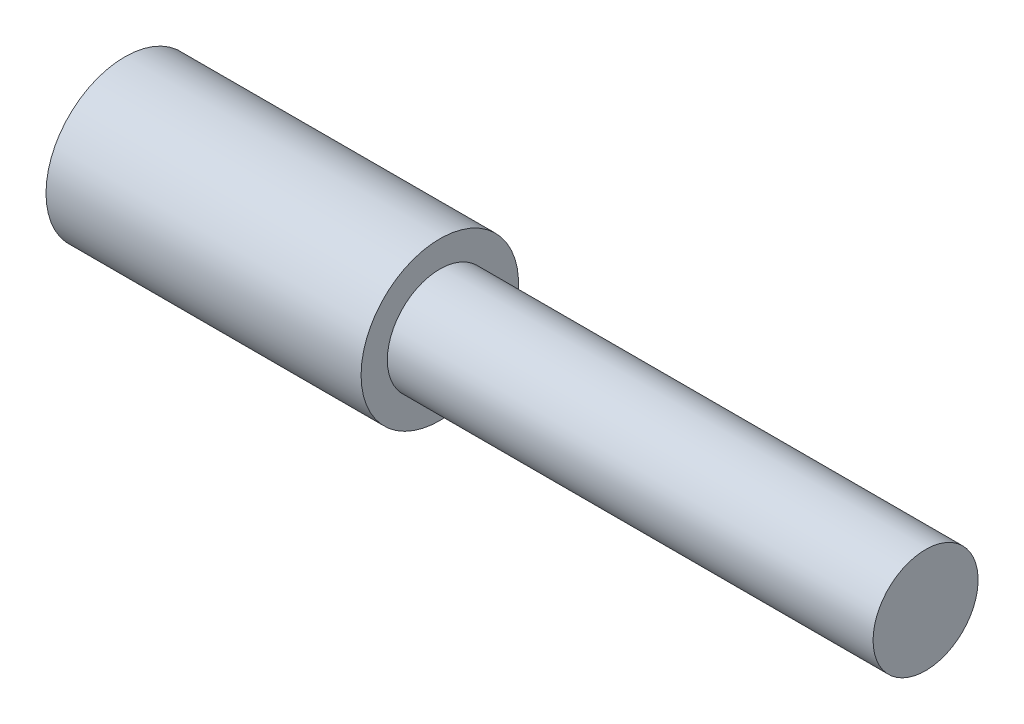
ISO-10303-21;
HEADER;
FILE_DESCRIPTION(('STEP AP214'),'2;1');
FILE_NAME('part.step','',(''),(''),'','','');
FILE_SCHEMA(('AUTOMOTIVE_DESIGN { 1 0 10303 214 1 1 1 1 }'));
ENDSEC;
DATA;
#1=APPLICATION_CONTEXT('core data for automotive mechanical design processes');
#2=APPLICATION_PROTOCOL_DEFINITION('international standard','automotive_design',2000,#1);
#3=PRODUCT_CONTEXT('',#1,'mechanical');
#4=PRODUCT('Part','Part','',(#3));
#5=PRODUCT_RELATED_PRODUCT_CATEGORY('part','',(#4));
#6=PRODUCT_DEFINITION_FORMATION('','',#4);
#7=PRODUCT_DEFINITION_CONTEXT('part definition',#1,'design');
#8=PRODUCT_DEFINITION('design','',#6,#7);
#9=PRODUCT_DEFINITION_SHAPE('','',#8);
#10=(LENGTH_UNIT() NAMED_UNIT(*) SI_UNIT(.MILLI.,.METRE.));
#11=(NAMED_UNIT(*) PLANE_ANGLE_UNIT() SI_UNIT($,.RADIAN.));
#12=(NAMED_UNIT(*) SI_UNIT($,.STERADIAN.) SOLID_ANGLE_UNIT());
#13=UNCERTAINTY_MEASURE_WITH_UNIT(LENGTH_MEASURE(1.E-05),#10,'distance_accuracy_value','');
#14=(GEOMETRIC_REPRESENTATION_CONTEXT(3) GLOBAL_UNCERTAINTY_ASSIGNED_CONTEXT((#13)) GLOBAL_UNIT_ASSIGNED_CONTEXT((#10,
#11,#12)) REPRESENTATION_CONTEXT('',''));
#15=CARTESIAN_POINT('',(0.,0.,0.));
#16=DIRECTION('',(0.,0.,1.));
#17=DIRECTION('',(1.,0.,0.));
#18=AXIS2_PLACEMENT_3D('',#15,#16,#17);
#19=CARTESIAN_POINT('',(90.,0.,0.));
#20=DIRECTION('',(-1.,0.,0.));
#21=DIRECTION('',(0.,0.,1.));
#22=AXIS2_PLACEMENT_3D('',#19,#20,#21);
#23=CYLINDRICAL_SURFACE('',#22,2.);
#24=CARTESIAN_POINT('',(61.,0.,0.));
#25=DIRECTION('',(-1.,0.,0.));
#26=DIRECTION('',(0.,0.,1.));
#27=AXIS2_PLACEMENT_3D('',#24,#25,#26);
#28=CIRCLE('',#27,2.);
#29=CARTESIAN_POINT('',(61.,0.,2.));
#30=VERTEX_POINT('',#29);
#31=EDGE_CURVE('E11',#30,#30,#28,.T.);
#32=CARTESIAN_POINT('',(79.5,0.,0.));
#33=DIRECTION('',(1.,0.,0.));
#34=DIRECTION('',(0.,0.,-1.));
#35=AXIS2_PLACEMENT_3D('',#32,#33,#34);
#36=CIRCLE('',#35,2.);
#37=CARTESIAN_POINT('',(79.5,0.,2.));
#38=VERTEX_POINT('',#37);
#39=EDGE_CURVE('E43',#38,#38,#36,.F.);
#40=CARTESIAN_POINT('',(61.,0.,2.));
#41=CARTESIAN_POINT('',(61.1927083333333,0.,2.));
#42=CARTESIAN_POINT('',(61.3854166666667,0.,2.));
#43=CARTESIAN_POINT('',(61.7708333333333,0.,2.));
#44=CARTESIAN_POINT('',(61.9635416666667,0.,2.));
#45=CARTESIAN_POINT('',(62.3489583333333,0.,2.));
#46=CARTESIAN_POINT('',(62.5416666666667,0.,2.));
#47=CARTESIAN_POINT('',(62.9270833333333,0.,2.));
#48=CARTESIAN_POINT('',(63.1197916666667,0.,2.));
#49=CARTESIAN_POINT('',(63.5052083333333,0.,2.));
#50=CARTESIAN_POINT('',(63.6979166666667,0.,2.));
#51=CARTESIAN_POINT('',(64.0833333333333,0.,2.));
#52=CARTESIAN_POINT('',(64.2760416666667,0.,2.));
#53=CARTESIAN_POINT('',(64.6614583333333,0.,2.));
#54=CARTESIAN_POINT('',(64.8541666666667,0.,2.));
#55=CARTESIAN_POINT('',(65.2395833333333,0.,2.));
#56=CARTESIAN_POINT('',(65.4322916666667,0.,2.));
#57=CARTESIAN_POINT('',(65.8177083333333,0.,2.));
#58=CARTESIAN_POINT('',(66.0104166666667,0.,2.));
#59=CARTESIAN_POINT('',(66.3958333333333,0.,2.));
#60=CARTESIAN_POINT('',(66.5885416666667,0.,2.));
#61=CARTESIAN_POINT('',(66.9739583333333,0.,2.));
#62=CARTESIAN_POINT('',(67.1666666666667,0.,2.));
#63=CARTESIAN_POINT('',(67.5520833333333,0.,2.));
#64=CARTESIAN_POINT('',(67.7447916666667,0.,2.));
#65=CARTESIAN_POINT('',(68.1302083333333,0.,2.));
#66=CARTESIAN_POINT('',(68.3229166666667,0.,2.));
#67=CARTESIAN_POINT('',(68.7083333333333,0.,2.));
#68=CARTESIAN_POINT('',(68.9010416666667,0.,2.));
#69=CARTESIAN_POINT('',(69.2864583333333,0.,2.));
#70=CARTESIAN_POINT('',(69.4791666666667,0.,2.));
#71=CARTESIAN_POINT('',(69.8645833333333,0.,2.));
#72=CARTESIAN_POINT('',(70.0572916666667,0.,2.));
#73=CARTESIAN_POINT('',(70.4427083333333,0.,2.));
#74=CARTESIAN_POINT('',(70.6354166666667,0.,2.));
#75=CARTESIAN_POINT('',(71.0208333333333,0.,2.));
#76=CARTESIAN_POINT('',(71.2135416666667,0.,2.));
#77=CARTESIAN_POINT('',(71.5989583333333,0.,2.));
#78=CARTESIAN_POINT('',(71.7916666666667,0.,2.));
#79=CARTESIAN_POINT('',(72.1770833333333,0.,2.));
#80=CARTESIAN_POINT('',(72.3697916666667,0.,2.));
#81=CARTESIAN_POINT('',(72.7552083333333,0.,2.));
#82=CARTESIAN_POINT('',(72.9479166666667,0.,2.));
#83=CARTESIAN_POINT('',(73.3333333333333,0.,2.));
#84=CARTESIAN_POINT('',(73.5260416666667,0.,2.));
#85=CARTESIAN_POINT('',(73.9114583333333,0.,2.));
#86=CARTESIAN_POINT('',(74.1041666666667,0.,2.));
#87=CARTESIAN_POINT('',(74.4895833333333,0.,2.));
#88=CARTESIAN_POINT('',(74.6822916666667,0.,2.));
#89=CARTESIAN_POINT('',(75.0677083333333,0.,2.));
#90=CARTESIAN_POINT('',(75.2604166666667,0.,2.));
#91=CARTESIAN_POINT('',(75.6458333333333,0.,2.));
#92=CARTESIAN_POINT('',(75.8385416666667,0.,2.));
#93=CARTESIAN_POINT('',(76.2239583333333,0.,2.));
#94=CARTESIAN_POINT('',(76.4166666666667,0.,2.));
#95=CARTESIAN_POINT('',(76.8020833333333,0.,2.));
#96=CARTESIAN_POINT('',(76.9947916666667,0.,2.));
#97=CARTESIAN_POINT('',(77.3802083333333,0.,2.));
#98=CARTESIAN_POINT('',(77.5729166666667,0.,2.));
#99=CARTESIAN_POINT('',(77.9583333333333,0.,2.));
#100=CARTESIAN_POINT('',(78.1510416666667,0.,2.));
#101=CARTESIAN_POINT('',(78.5364583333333,0.,2.));
#102=CARTESIAN_POINT('',(78.7291666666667,0.,2.));
#103=CARTESIAN_POINT('',(79.1145833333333,0.,2.));
#104=CARTESIAN_POINT('',(79.3072916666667,0.,2.));
#105=CARTESIAN_POINT('',(79.5,0.,2.));
#106=B_SPLINE_CURVE_WITH_KNOTS('',3,(#40,#41,#42,#43,#44,#45,#46,#47,#48,#49,#50,#51,#52,#53,
#54,#55,#56,#57,#58,#59,#60,#61,#62,#63,#64,#65,#66,#67,#68,#69,#70,#71,#72,#73,#74,#75,#76,#77,
#78,#79,#80,#81,#82,#83,#84,#85,#86,#87,#88,#89,#90,#91,#92,#93,#94,#95,#96,#97,#98,#99,#100,
#101,#102,#103,#104,#105),.UNSPECIFIED.,.F.,.F.,(4,2,2,2,2,2,2,2,2,2,2,2,2,2,2,2,2,2,2,2,2,2,2,
2,2,2,2,2,2,2,2,2,4),(0.,0.578124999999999,1.15625,1.73437500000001,2.3125,2.89062500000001,
3.46875000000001,4.04687500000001,4.625,5.203125,5.78125,6.359375,6.9375,7.515625,8.09375,
8.671875,9.25000000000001,9.82812500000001,10.40625,10.984375,11.5625,12.140625,12.71875,
13.296875,13.875,14.453125,15.03125,15.609375,16.1875,16.765625,17.34375,17.921875,18.5),.UNSPECIFIED.);
#107=EDGE_CURVE('BSEAM30',#30,#38,#106,.T.);
#108=ORIENTED_EDGE('',*,*,#31,.F.);
#109=ORIENTED_EDGE('',*,*,#39,.T.);
#110=ORIENTED_EDGE('',*,*,#107,.T.);
#111=ORIENTED_EDGE('',*,*,#107,.F.);
#112=EDGE_LOOP('',(#108,#110,#109,#111));
#113=FACE_BOUND('',#112,.T.);
#114=ADVANCED_FACE('F30',(#113),#23,.T.);
#115=CARTESIAN_POINT('',(49.,0.,0.));
#116=DIRECTION('',(1.,0.,0.));
#117=DIRECTION('',(0.,0.,-1.));
#118=AXIS2_PLACEMENT_3D('',#115,#116,#117);
#119=PLANE('',#118);
#120=CARTESIAN_POINT('',(49.,0.,0.));
#121=DIRECTION('',(1.,0.,0.));
#122=DIRECTION('',(0.,0.,-1.));
#123=AXIS2_PLACEMENT_3D('',#120,#121,#122);
#124=CIRCLE('',#123,3.);
#125=CARTESIAN_POINT('',(49.,0.,-3.));
#126=VERTEX_POINT('',#125);
#127=EDGE_CURVE('E33',#126,#126,#124,.T.);
#128=ORIENTED_EDGE('',*,*,#127,.F.);
#129=EDGE_LOOP('',(#128));
#130=FACE_BOUND('',#129,.T.);
#131=ADVANCED_FACE('F53',(#130),#119,.F.);
#132=CARTESIAN_POINT('',(61.,0.,0.));
#133=DIRECTION('',(-1.,0.,0.));
#134=DIRECTION('',(0.,0.,1.));
#135=AXIS2_PLACEMENT_3D('',#132,#133,#134);
#136=PLANE('',#135);
#137=CARTESIAN_POINT('',(61.,0.,0.));
#138=DIRECTION('',(-1.,0.,0.));
#139=DIRECTION('',(0.,0.,1.));
#140=AXIS2_PLACEMENT_3D('',#137,#138,#139);
#141=CIRCLE('',#140,3.);
#142=CARTESIAN_POINT('',(61.,0.,3.));
#143=VERTEX_POINT('',#142);
#144=EDGE_CURVE('E37',#143,#143,#141,.T.);
#145=ORIENTED_EDGE('',*,*,#144,.F.);
#146=EDGE_LOOP('',(#145));
#147=FACE_BOUND('',#146,.T.);
#148=ORIENTED_EDGE('',*,*,#31,.T.);
#149=EDGE_LOOP('',(#148));
#150=FACE_BOUND('',#149,.T.);
#151=ADVANCED_FACE('F55',(#147,#150),#136,.F.);
#152=CARTESIAN_POINT('',(69.4852813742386,0.,0.));
#153=DIRECTION('',(-1.,0.,0.));
#154=DIRECTION('',(0.,0.,1.));
#155=AXIS2_PLACEMENT_3D('',#152,#153,#154);
#156=CYLINDRICAL_SURFACE('',#155,3.);
#157=ORIENTED_EDGE('',*,*,#127,.T.);
#158=EDGE_LOOP('',(#157));
#159=FACE_BOUND('',#158,.T.);
#160=ORIENTED_EDGE('',*,*,#144,.T.);
#161=EDGE_LOOP('',(#160));
#162=FACE_BOUND('',#161,.T.);
#163=ADVANCED_FACE('F50',(#159,#162),#156,.T.);
#164=CARTESIAN_POINT('',(79.5,5.14431626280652,3.08804310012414));
#165=DIRECTION('',(1.,0.,0.));
#166=DIRECTION('',(0.,0.514673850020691,-0.857386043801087));
#167=AXIS2_PLACEMENT_3D('',#164,#165,#166);
#168=PLANE('',#167);
#169=ORIENTED_EDGE('',*,*,#39,.F.);
#170=EDGE_LOOP('',(#169));
#171=FACE_BOUND('',#170,.T.);
#172=ADVANCED_FACE('F65',(#171),#168,.T.);
#173=CLOSED_SHELL('',(#114,#131,#151,#163,#172));
#174=MANIFOLD_SOLID_BREP('B2',#173);
#175=ADVANCED_BREP_SHAPE_REPRESENTATION('',(#18,#174),#14);
#176=SHAPE_DEFINITION_REPRESENTATION(#9,#175);
ENDSEC;
END-ISO-10303-21;
